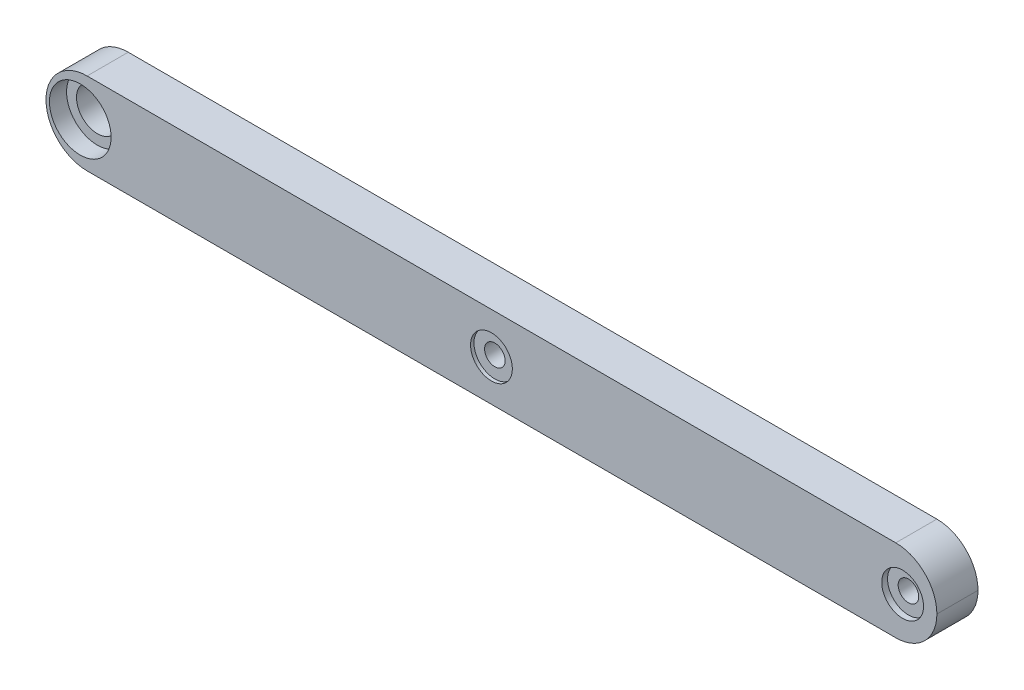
ISO-10303-21;
HEADER;
FILE_DESCRIPTION(('STEP AP214'),'2;1');
FILE_NAME('part.step','',(''),(''),'','','');
FILE_SCHEMA(('AUTOMOTIVE_DESIGN { 1 0 10303 214 1 1 1 1 }'));
ENDSEC;
DATA;
#1=APPLICATION_CONTEXT('core data for automotive mechanical design processes');
#2=APPLICATION_PROTOCOL_DEFINITION('international standard','automotive_design',2000,#1);
#3=PRODUCT_CONTEXT('',#1,'mechanical');
#4=PRODUCT('Part','Part','',(#3));
#5=PRODUCT_RELATED_PRODUCT_CATEGORY('part','',(#4));
#6=PRODUCT_DEFINITION_FORMATION('','',#4);
#7=PRODUCT_DEFINITION_CONTEXT('part definition',#1,'design');
#8=PRODUCT_DEFINITION('design','',#6,#7);
#9=PRODUCT_DEFINITION_SHAPE('','',#8);
#10=(LENGTH_UNIT() NAMED_UNIT(*) SI_UNIT(.MILLI.,.METRE.));
#11=(NAMED_UNIT(*) PLANE_ANGLE_UNIT() SI_UNIT($,.RADIAN.));
#12=(NAMED_UNIT(*) SI_UNIT($,.STERADIAN.) SOLID_ANGLE_UNIT());
#13=UNCERTAINTY_MEASURE_WITH_UNIT(LENGTH_MEASURE(1.E-05),#10,'distance_accuracy_value','');
#14=(GEOMETRIC_REPRESENTATION_CONTEXT(3) GLOBAL_UNCERTAINTY_ASSIGNED_CONTEXT((#13)) GLOBAL_UNIT_ASSIGNED_CONTEXT((#10,
#11,#12)) REPRESENTATION_CONTEXT('',''));
#15=CARTESIAN_POINT('',(0.,0.,0.));
#16=DIRECTION('',(0.,0.,1.));
#17=DIRECTION('',(1.,0.,0.));
#18=AXIS2_PLACEMENT_3D('',#15,#16,#17);
#19=CARTESIAN_POINT('',(55.3610271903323,6.23957703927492,0.));
#20=DIRECTION('',(0.,0.,1.));
#21=DIRECTION('',(1.,0.,0.));
#22=AXIS2_PLACEMENT_3D('',#19,#20,#21);
#23=CYLINDRICAL_SURFACE('',#22,1.5);
#24=CARTESIAN_POINT('',(55.3610271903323,6.23957703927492,0.));
#25=DIRECTION('',(0.,0.,1.));
#26=DIRECTION('',(1.,0.,0.));
#27=AXIS2_PLACEMENT_3D('',#24,#25,#26);
#28=CIRCLE('',#27,1.5);
#29=CARTESIAN_POINT('',(56.8610271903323,6.23957703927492,0.));
#30=VERTEX_POINT('',#29);
#31=EDGE_CURVE('E112',#30,#30,#28,.T.);
#32=ORIENTED_EDGE('',*,*,#31,.F.);
#33=EDGE_LOOP('',(#32));
#34=FACE_BOUND('',#33,.T.);
#35=CARTESIAN_POINT('',(55.3610271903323,6.23957703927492,5.15));
#36=DIRECTION('',(0.,0.,1.));
#37=DIRECTION('',(1.,0.,0.));
#38=AXIS2_PLACEMENT_3D('',#35,#36,#37);
#39=CIRCLE('',#38,1.5);
#40=CARTESIAN_POINT('',(56.8610271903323,6.23957703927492,5.15));
#41=VERTEX_POINT('',#40);
#42=EDGE_CURVE('E36',#41,#41,#39,.F.);
#43=ORIENTED_EDGE('',*,*,#42,.F.);
#44=EDGE_LOOP('',(#43));
#45=FACE_BOUND('',#44,.T.);
#46=ADVANCED_FACE('F32',(#34,#45),#23,.F.);
#47=CARTESIAN_POINT('',(-64.6389728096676,6.23957703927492,0.));
#48=DIRECTION('',(0.,0.,1.));
#49=DIRECTION('',(1.,0.,0.));
#50=AXIS2_PLACEMENT_3D('',#47,#48,#49);
#51=CYLINDRICAL_SURFACE('',#50,3.05);
#52=CARTESIAN_POINT('',(-64.6389728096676,6.23957703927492,0.));
#53=DIRECTION('',(0.,0.,1.));
#54=DIRECTION('',(1.,0.,0.));
#55=AXIS2_PLACEMENT_3D('',#52,#53,#54);
#56=CIRCLE('',#55,3.05);
#57=CARTESIAN_POINT('',(-61.5889728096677,6.23957703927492,0.));
#58=VERTEX_POINT('',#57);
#59=EDGE_CURVE('E116',#58,#58,#56,.T.);
#60=ORIENTED_EDGE('',*,*,#59,.F.);
#61=EDGE_LOOP('',(#60));
#62=FACE_BOUND('',#61,.T.);
#63=CARTESIAN_POINT('',(-64.6389728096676,6.23957703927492,3.5));
#64=DIRECTION('',(0.,0.,1.));
#65=DIRECTION('',(1.,0.,0.));
#66=AXIS2_PLACEMENT_3D('',#63,#64,#65);
#67=CIRCLE('',#66,3.05);
#68=CARTESIAN_POINT('',(-61.5889728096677,6.23957703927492,3.5));
#69=VERTEX_POINT('',#68);
#70=EDGE_CURVE('E140',#69,#69,#67,.F.);
#71=ORIENTED_EDGE('',*,*,#70,.F.);
#72=EDGE_LOOP('',(#71));
#73=FACE_BOUND('',#72,.T.);
#74=ADVANCED_FACE('F169',(#62,#73),#51,.F.);
#75=CARTESIAN_POINT('',(-4.63897280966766,6.23957703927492,0.));
#76=DIRECTION('',(0.,0.,1.));
#77=DIRECTION('',(1.,0.,0.));
#78=AXIS2_PLACEMENT_3D('',#75,#76,#77);
#79=CYLINDRICAL_SURFACE('',#78,1.5);
#80=CARTESIAN_POINT('',(-4.63897280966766,6.23957703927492,0.));
#81=DIRECTION('',(0.,0.,1.));
#82=DIRECTION('',(1.,0.,0.));
#83=AXIS2_PLACEMENT_3D('',#80,#81,#82);
#84=CIRCLE('',#83,1.5);
#85=CARTESIAN_POINT('',(-3.13897280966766,6.23957703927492,0.));
#86=VERTEX_POINT('',#85);
#87=EDGE_CURVE('E162',#86,#86,#84,.T.);
#88=ORIENTED_EDGE('',*,*,#87,.F.);
#89=EDGE_LOOP('',(#88));
#90=FACE_BOUND('',#89,.T.);
#91=CARTESIAN_POINT('',(-4.63897280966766,6.23957703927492,5.5));
#92=DIRECTION('',(0.,0.,1.));
#93=DIRECTION('',(1.,0.,0.));
#94=AXIS2_PLACEMENT_3D('',#91,#92,#93);
#95=CIRCLE('',#94,1.5);
#96=CARTESIAN_POINT('',(-3.13897280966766,6.23957703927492,5.5));
#97=VERTEX_POINT('',#96);
#98=EDGE_CURVE('E136',#97,#97,#95,.F.);
#99=ORIENTED_EDGE('',*,*,#98,.F.);
#100=EDGE_LOOP('',(#99));
#101=FACE_BOUND('',#100,.T.);
#102=ADVANCED_FACE('F172',(#90,#101),#79,.F.);
#103=CARTESIAN_POINT('',(-69.6389728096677,0.239577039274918,6.));
#104=DIRECTION('',(0.,1.,0.));
#105=DIRECTION('',(0.,0.,1.));
#106=AXIS2_PLACEMENT_3D('',#103,#104,#105);
#107=PLANE('',#106);
#108=DIRECTION('',(1.,0.,0.));
#109=VECTOR('',#108,1.);
#110=CARTESIAN_POINT('',(-69.6389728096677,0.239577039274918,6.));
#111=LINE('',#110,#109);
#112=CARTESIAN_POINT('',(-63.6389728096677,0.239577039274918,6.));
#113=VERTEX_POINT('',#112);
#114=CARTESIAN_POINT('',(54.3610271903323,0.239577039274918,6.));
#115=VERTEX_POINT('',#114);
#116=EDGE_CURVE('E105',#113,#115,#111,.T.);
#117=ORIENTED_EDGE('',*,*,#116,.F.);
#118=DIRECTION('',(0.,0.,-1.));
#119=VECTOR('',#118,1.);
#120=CARTESIAN_POINT('',(-63.6389728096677,0.239577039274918,6.));
#121=LINE('',#120,#119);
#122=CARTESIAN_POINT('',(-63.6389728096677,0.239577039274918,0.));
#123=VERTEX_POINT('',#122);
#124=EDGE_CURVE('E90',#113,#123,#121,.T.);
#125=ORIENTED_EDGE('',*,*,#124,.T.);
#126=DIRECTION('',(1.,0.,0.));
#127=VECTOR('',#126,1.);
#128=CARTESIAN_POINT('',(-69.6389728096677,0.239577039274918,0.));
#129=LINE('',#128,#127);
#130=CARTESIAN_POINT('',(54.3610271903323,0.239577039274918,0.));
#131=VERTEX_POINT('',#130);
#132=EDGE_CURVE('E102',#123,#131,#129,.T.);
#133=ORIENTED_EDGE('',*,*,#132,.T.);
#134=DIRECTION('',(0.,0.,-1.));
#135=VECTOR('',#134,1.);
#136=CARTESIAN_POINT('',(54.3610271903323,0.239577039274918,6.));
#137=LINE('',#136,#135);
#138=EDGE_CURVE('E107',#131,#115,#137,.F.);
#139=ORIENTED_EDGE('',*,*,#138,.T.);
#140=EDGE_LOOP('',(#117,#125,#133,#139));
#141=FACE_BOUND('',#140,.T.);
#142=ADVANCED_FACE('F34',(#141),#107,.F.);
#143=CARTESIAN_POINT('',(-69.6389728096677,12.2395770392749,6.));
#144=DIRECTION('',(0.,-1.,0.));
#145=DIRECTION('',(0.,0.,-1.));
#146=AXIS2_PLACEMENT_3D('',#143,#144,#145);
#147=PLANE('',#146);
#148=DIRECTION('',(-1.,0.,0.));
#149=VECTOR('',#148,1.);
#150=CARTESIAN_POINT('',(-69.6389728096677,12.2395770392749,0.));
#151=LINE('',#150,#149);
#152=CARTESIAN_POINT('',(54.3610271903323,12.2395770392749,0.));
#153=VERTEX_POINT('',#152);
#154=CARTESIAN_POINT('',(-63.6389728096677,12.2395770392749,0.));
#155=VERTEX_POINT('',#154);
#156=EDGE_CURVE('E111',#153,#155,#151,.T.);
#157=ORIENTED_EDGE('',*,*,#156,.T.);
#158=DIRECTION('',(0.,0.,-1.));
#159=VECTOR('',#158,1.);
#160=CARTESIAN_POINT('',(-63.6389728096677,12.2395770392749,6.));
#161=LINE('',#160,#159);
#162=CARTESIAN_POINT('',(-63.6389728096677,12.2395770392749,6.));
#163=VERTEX_POINT('',#162);
#164=EDGE_CURVE('E11',#155,#163,#161,.F.);
#165=ORIENTED_EDGE('',*,*,#164,.T.);
#166=DIRECTION('',(-1.,0.,0.));
#167=VECTOR('',#166,1.);
#168=CARTESIAN_POINT('',(-69.6389728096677,12.2395770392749,6.));
#169=LINE('',#168,#167);
#170=CARTESIAN_POINT('',(54.3610271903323,12.2395770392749,6.));
#171=VERTEX_POINT('',#170);
#172=EDGE_CURVE('E121',#171,#163,#169,.T.);
#173=ORIENTED_EDGE('',*,*,#172,.F.);
#174=DIRECTION('',(0.,0.,-1.));
#175=VECTOR('',#174,1.);
#176=CARTESIAN_POINT('',(54.3610271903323,12.2395770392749,6.));
#177=LINE('',#176,#175);
#178=EDGE_CURVE('E41',#171,#153,#177,.T.);
#179=ORIENTED_EDGE('',*,*,#178,.T.);
#180=EDGE_LOOP('',(#157,#165,#173,#179));
#181=FACE_BOUND('',#180,.T.);
#182=ADVANCED_FACE('F190',(#181),#147,.F.);
#183=CARTESIAN_POINT('',(-69.6389728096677,0.239577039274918,6.));
#184=DIRECTION('',(0.,0.,1.));
#185=DIRECTION('',(1.,0.,0.));
#186=AXIS2_PLACEMENT_3D('',#183,#184,#185);
#187=PLANE('',#186);
#188=CARTESIAN_POINT('',(55.3610271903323,6.23957703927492,6.));
#189=DIRECTION('',(0.,0.,1.));
#190=DIRECTION('',(1.,0.,0.));
#191=AXIS2_PLACEMENT_3D('',#188,#189,#190);
#192=CIRCLE('',#191,3.05);
#193=CARTESIAN_POINT('',(58.4110271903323,6.23957703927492,6.));
#194=VERTEX_POINT('',#193);
#195=EDGE_CURVE('E366',#194,#194,#192,.T.);
#196=ORIENTED_EDGE('',*,*,#195,.F.);
#197=EDGE_LOOP('',(#196));
#198=FACE_BOUND('',#197,.T.);
#199=CARTESIAN_POINT('',(-64.6389728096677,6.23957703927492,6.));
#200=DIRECTION('',(0.,0.,1.));
#201=DIRECTION('',(1.,0.,0.));
#202=AXIS2_PLACEMENT_3D('',#199,#200,#201);
#203=CIRCLE('',#202,4.5);
#204=CARTESIAN_POINT('',(-60.1389728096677,6.23957703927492,6.));
#205=VERTEX_POINT('',#204);
#206=EDGE_CURVE('E149',#205,#205,#203,.T.);
#207=ORIENTED_EDGE('',*,*,#206,.F.);
#208=EDGE_LOOP('',(#207));
#209=FACE_BOUND('',#208,.T.);
#210=CARTESIAN_POINT('',(-4.63897280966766,6.23957703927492,6.));
#211=DIRECTION('',(0.,0.,1.));
#212=DIRECTION('',(1.,0.,0.));
#213=AXIS2_PLACEMENT_3D('',#210,#211,#212);
#214=CIRCLE('',#213,3.05);
#215=CARTESIAN_POINT('',(-1.58897280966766,6.23957703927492,6.));
#216=VERTEX_POINT('',#215);
#217=EDGE_CURVE('E142',#216,#216,#214,.T.);
#218=ORIENTED_EDGE('',*,*,#217,.F.);
#219=EDGE_LOOP('',(#218));
#220=FACE_BOUND('',#219,.T.);
#221=CARTESIAN_POINT('',(-63.6389728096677,6.23957703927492,6.));
#222=DIRECTION('',(0.,0.,1.));
#223=DIRECTION('',(1.,0.,0.));
#224=AXIS2_PLACEMENT_3D('',#221,#222,#223);
#225=CIRCLE('',#224,6.);
#226=CARTESIAN_POINT('',(-69.6389728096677,6.23957703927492,6.));
#227=VERTEX_POINT('',#226);
#228=EDGE_CURVE('E130',#163,#227,#225,.T.);
#229=ORIENTED_EDGE('',*,*,#228,.T.);
#230=CARTESIAN_POINT('',(-63.6389728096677,6.23957703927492,6.));
#231=DIRECTION('',(0.,0.,1.));
#232=DIRECTION('',(1.,0.,0.));
#233=AXIS2_PLACEMENT_3D('',#230,#231,#232);
#234=CIRCLE('',#233,6.);
#235=EDGE_CURVE('E132',#227,#113,#234,.T.);
#236=ORIENTED_EDGE('',*,*,#235,.T.);
#237=ORIENTED_EDGE('',*,*,#116,.T.);
#238=CARTESIAN_POINT('',(54.3610271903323,6.23957703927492,6.));
#239=DIRECTION('',(0.,0.,1.));
#240=DIRECTION('',(1.,0.,0.));
#241=AXIS2_PLACEMENT_3D('',#238,#239,#240);
#242=CIRCLE('',#241,6.);
#243=CARTESIAN_POINT('',(60.3610271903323,6.23957703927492,6.));
#244=VERTEX_POINT('',#243);
#245=EDGE_CURVE('E96',#115,#244,#242,.T.);
#246=ORIENTED_EDGE('',*,*,#245,.T.);
#247=CARTESIAN_POINT('',(54.3610271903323,6.23957703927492,6.));
#248=DIRECTION('',(0.,0.,1.));
#249=DIRECTION('',(1.,0.,0.));
#250=AXIS2_PLACEMENT_3D('',#247,#248,#249);
#251=CIRCLE('',#250,6.);
#252=EDGE_CURVE('E54',#244,#171,#251,.T.);
#253=ORIENTED_EDGE('',*,*,#252,.T.);
#254=ORIENTED_EDGE('',*,*,#172,.T.);
#255=EDGE_LOOP('',(#229,#236,#237,#246,#253,#254));
#256=FACE_BOUND('',#255,.T.);
#257=ADVANCED_FACE('F187',(#198,#209,#220,#256),#187,.T.);
#258=CARTESIAN_POINT('',(-69.6389728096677,0.239577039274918,0.));
#259=DIRECTION('',(0.,0.,1.));
#260=DIRECTION('',(1.,0.,0.));
#261=AXIS2_PLACEMENT_3D('',#258,#259,#260);
#262=PLANE('',#261);
#263=ORIENTED_EDGE('',*,*,#87,.T.);
#264=EDGE_LOOP('',(#263));
#265=FACE_BOUND('',#264,.T.);
#266=ORIENTED_EDGE('',*,*,#59,.T.);
#267=EDGE_LOOP('',(#266));
#268=FACE_BOUND('',#267,.T.);
#269=ORIENTED_EDGE('',*,*,#31,.T.);
#270=EDGE_LOOP('',(#269));
#271=FACE_BOUND('',#270,.T.);
#272=ORIENTED_EDGE('',*,*,#132,.F.);
#273=CARTESIAN_POINT('',(-63.6389728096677,6.23957703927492,0.));
#274=DIRECTION('',(0.,0.,1.));
#275=DIRECTION('',(1.,0.,0.));
#276=AXIS2_PLACEMENT_3D('',#273,#274,#275);
#277=CIRCLE('',#276,6.);
#278=CARTESIAN_POINT('',(-69.6389728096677,6.23957703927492,0.));
#279=VERTEX_POINT('',#278);
#280=EDGE_CURVE('E86',#123,#279,#277,.F.);
#281=ORIENTED_EDGE('',*,*,#280,.T.);
#282=CARTESIAN_POINT('',(-63.6389728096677,6.23957703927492,0.));
#283=DIRECTION('',(0.,0.,1.));
#284=DIRECTION('',(1.,0.,0.));
#285=AXIS2_PLACEMENT_3D('',#282,#283,#284);
#286=CIRCLE('',#285,6.);
#287=EDGE_CURVE('E97',#279,#155,#286,.F.);
#288=ORIENTED_EDGE('',*,*,#287,.T.);
#289=ORIENTED_EDGE('',*,*,#156,.F.);
#290=CARTESIAN_POINT('',(54.3610271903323,6.23957703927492,0.));
#291=DIRECTION('',(0.,0.,1.));
#292=DIRECTION('',(1.,0.,0.));
#293=AXIS2_PLACEMENT_3D('',#290,#291,#292);
#294=CIRCLE('',#293,6.);
#295=CARTESIAN_POINT('',(60.3610271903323,6.23957703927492,0.));
#296=VERTEX_POINT('',#295);
#297=EDGE_CURVE('E125',#153,#296,#294,.F.);
#298=ORIENTED_EDGE('',*,*,#297,.T.);
#299=CARTESIAN_POINT('',(54.3610271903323,6.23957703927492,0.));
#300=DIRECTION('',(0.,0.,1.));
#301=DIRECTION('',(1.,0.,0.));
#302=AXIS2_PLACEMENT_3D('',#299,#300,#301);
#303=CIRCLE('',#302,6.);
#304=EDGE_CURVE('E106',#296,#131,#303,.F.);
#305=ORIENTED_EDGE('',*,*,#304,.T.);
#306=EDGE_LOOP('',(#272,#281,#288,#289,#298,#305));
#307=FACE_BOUND('',#306,.T.);
#308=ADVANCED_FACE('F109',(#265,#268,#271,#307),#262,.F.);
#309=CARTESIAN_POINT('',(-63.6389728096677,6.23957703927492,6.));
#310=DIRECTION('',(0.,0.,-1.));
#311=DIRECTION('',(-1.,0.,0.));
#312=AXIS2_PLACEMENT_3D('',#309,#310,#311);
#313=CYLINDRICAL_SURFACE('',#312,6.);
#314=DIRECTION('',(0.,0.,-1.));
#315=VECTOR('',#314,1.);
#316=CARTESIAN_POINT('',(-69.6389728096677,6.23957703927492,6.));
#317=LINE('',#316,#315);
#318=EDGE_CURVE('E92',#227,#279,#317,.T.);
#319=ORIENTED_EDGE('',*,*,#318,.F.);
#320=ORIENTED_EDGE('',*,*,#228,.F.);
#321=ORIENTED_EDGE('',*,*,#164,.F.);
#322=ORIENTED_EDGE('',*,*,#287,.F.);
#323=EDGE_LOOP('',(#319,#320,#321,#322));
#324=FACE_BOUND('',#323,.T.);
#325=ADVANCED_FACE('F186',(#324),#313,.T.);
#326=CARTESIAN_POINT('',(-63.6389728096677,6.23957703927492,6.));
#327=DIRECTION('',(0.,0.,-1.));
#328=DIRECTION('',(-1.,0.,0.));
#329=AXIS2_PLACEMENT_3D('',#326,#327,#328);
#330=CYLINDRICAL_SURFACE('',#329,6.);
#331=ORIENTED_EDGE('',*,*,#235,.F.);
#332=ORIENTED_EDGE('',*,*,#318,.T.);
#333=ORIENTED_EDGE('',*,*,#280,.F.);
#334=ORIENTED_EDGE('',*,*,#124,.F.);
#335=EDGE_LOOP('',(#331,#332,#333,#334));
#336=FACE_BOUND('',#335,.T.);
#337=ADVANCED_FACE('F89',(#336),#330,.T.);
#338=CARTESIAN_POINT('',(54.3610271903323,6.23957703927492,6.));
#339=DIRECTION('',(0.,0.,-1.));
#340=DIRECTION('',(-1.,0.,0.));
#341=AXIS2_PLACEMENT_3D('',#338,#339,#340);
#342=CYLINDRICAL_SURFACE('',#341,6.);
#343=DIRECTION('',(0.,0.,-1.));
#344=VECTOR('',#343,1.);
#345=CARTESIAN_POINT('',(60.3610271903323,6.23957703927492,6.));
#346=LINE('',#345,#344);
#347=EDGE_CURVE('E138',#244,#296,#346,.T.);
#348=ORIENTED_EDGE('',*,*,#347,.F.);
#349=ORIENTED_EDGE('',*,*,#245,.F.);
#350=ORIENTED_EDGE('',*,*,#138,.F.);
#351=ORIENTED_EDGE('',*,*,#304,.F.);
#352=EDGE_LOOP('',(#348,#349,#350,#351));
#353=FACE_BOUND('',#352,.T.);
#354=ADVANCED_FACE('F204',(#353),#342,.T.);
#355=CARTESIAN_POINT('',(54.3610271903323,6.23957703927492,6.));
#356=DIRECTION('',(0.,0.,-1.));
#357=DIRECTION('',(-1.,0.,0.));
#358=AXIS2_PLACEMENT_3D('',#355,#356,#357);
#359=CYLINDRICAL_SURFACE('',#358,6.);
#360=ORIENTED_EDGE('',*,*,#252,.F.);
#361=ORIENTED_EDGE('',*,*,#347,.T.);
#362=ORIENTED_EDGE('',*,*,#297,.F.);
#363=ORIENTED_EDGE('',*,*,#178,.F.);
#364=EDGE_LOOP('',(#360,#361,#362,#363));
#365=FACE_BOUND('',#364,.T.);
#366=ADVANCED_FACE('F201',(#365),#359,.T.);
#367=CARTESIAN_POINT('',(-4.63897280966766,6.23957703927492,5.5));
#368=DIRECTION('',(0.,0.,1.));
#369=DIRECTION('',(1.,0.,0.));
#370=AXIS2_PLACEMENT_3D('',#367,#368,#369);
#371=PLANE('',#370);
#372=CARTESIAN_POINT('',(-4.63897280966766,6.23957703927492,5.5));
#373=DIRECTION('',(0.,0.,1.));
#374=DIRECTION('',(1.,0.,0.));
#375=AXIS2_PLACEMENT_3D('',#372,#373,#374);
#376=CIRCLE('',#375,3.05);
#377=CARTESIAN_POINT('',(-1.58897280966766,6.23957703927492,5.5));
#378=VERTEX_POINT('',#377);
#379=EDGE_CURVE('E139',#378,#378,#376,.T.);
#380=ORIENTED_EDGE('',*,*,#379,.T.);
#381=EDGE_LOOP('',(#380));
#382=FACE_BOUND('',#381,.T.);
#383=ORIENTED_EDGE('',*,*,#98,.T.);
#384=EDGE_LOOP('',(#383));
#385=FACE_BOUND('',#384,.T.);
#386=ADVANCED_FACE('F212',(#382,#385),#371,.T.);
#387=CARTESIAN_POINT('',(-4.63897280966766,6.23957703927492,5.5));
#388=DIRECTION('',(0.,0.,1.));
#389=DIRECTION('',(1.,0.,0.));
#390=AXIS2_PLACEMENT_3D('',#387,#388,#389);
#391=CYLINDRICAL_SURFACE('',#390,3.05);
#392=ORIENTED_EDGE('',*,*,#379,.F.);
#393=EDGE_LOOP('',(#392));
#394=FACE_BOUND('',#393,.T.);
#395=ORIENTED_EDGE('',*,*,#217,.T.);
#396=EDGE_LOOP('',(#395));
#397=FACE_BOUND('',#396,.T.);
#398=ADVANCED_FACE('F245',(#394,#397),#391,.F.);
#399=CARTESIAN_POINT('',(-64.6389728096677,6.23957703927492,3.5));
#400=DIRECTION('',(0.,0.,1.));
#401=DIRECTION('',(1.,0.,0.));
#402=AXIS2_PLACEMENT_3D('',#399,#400,#401);
#403=PLANE('',#402);
#404=CARTESIAN_POINT('',(-64.6389728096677,6.23957703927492,3.5));
#405=DIRECTION('',(0.,0.,1.));
#406=DIRECTION('',(1.,0.,0.));
#407=AXIS2_PLACEMENT_3D('',#404,#405,#406);
#408=CIRCLE('',#407,4.5);
#409=CARTESIAN_POINT('',(-60.1389728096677,6.23957703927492,3.5));
#410=VERTEX_POINT('',#409);
#411=EDGE_CURVE('E143',#410,#410,#408,.T.);
#412=ORIENTED_EDGE('',*,*,#411,.T.);
#413=EDGE_LOOP('',(#412));
#414=FACE_BOUND('',#413,.T.);
#415=ORIENTED_EDGE('',*,*,#70,.T.);
#416=EDGE_LOOP('',(#415));
#417=FACE_BOUND('',#416,.T.);
#418=ADVANCED_FACE('F254',(#414,#417),#403,.T.);
#419=CARTESIAN_POINT('',(-64.6389728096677,6.23957703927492,3.5));
#420=DIRECTION('',(0.,0.,1.));
#421=DIRECTION('',(1.,0.,0.));
#422=AXIS2_PLACEMENT_3D('',#419,#420,#421);
#423=CYLINDRICAL_SURFACE('',#422,4.5);
#424=ORIENTED_EDGE('',*,*,#411,.F.);
#425=EDGE_LOOP('',(#424));
#426=FACE_BOUND('',#425,.T.);
#427=ORIENTED_EDGE('',*,*,#206,.T.);
#428=EDGE_LOOP('',(#427));
#429=FACE_BOUND('',#428,.T.);
#430=ADVANCED_FACE('F264',(#426,#429),#423,.F.);
#431=CARTESIAN_POINT('',(55.3610271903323,6.23957703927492,5.15));
#432=DIRECTION('',(0.,0.,1.));
#433=DIRECTION('',(1.,0.,0.));
#434=AXIS2_PLACEMENT_3D('',#431,#432,#433);
#435=PLANE('',#434);
#436=CARTESIAN_POINT('',(55.3610271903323,6.23957703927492,5.15));
#437=DIRECTION('',(0.,0.,1.));
#438=DIRECTION('',(1.,0.,0.));
#439=AXIS2_PLACEMENT_3D('',#436,#437,#438);
#440=CIRCLE('',#439,3.05);
#441=CARTESIAN_POINT('',(58.4110271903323,6.23957703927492,5.15));
#442=VERTEX_POINT('',#441);
#443=EDGE_CURVE('E363',#442,#442,#440,.T.);
#444=ORIENTED_EDGE('',*,*,#443,.T.);
#445=EDGE_LOOP('',(#444));
#446=FACE_BOUND('',#445,.T.);
#447=ORIENTED_EDGE('',*,*,#42,.T.);
#448=EDGE_LOOP('',(#447));
#449=FACE_BOUND('',#448,.T.);
#450=ADVANCED_FACE('F271',(#446,#449),#435,.T.);
#451=CARTESIAN_POINT('',(55.3610271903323,6.23957703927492,5.15));
#452=DIRECTION('',(0.,0.,1.));
#453=DIRECTION('',(1.,0.,0.));
#454=AXIS2_PLACEMENT_3D('',#451,#452,#453);
#455=CYLINDRICAL_SURFACE('',#454,3.05);
#456=ORIENTED_EDGE('',*,*,#443,.F.);
#457=EDGE_LOOP('',(#456));
#458=FACE_BOUND('',#457,.T.);
#459=ORIENTED_EDGE('',*,*,#195,.T.);
#460=EDGE_LOOP('',(#459));
#461=FACE_BOUND('',#460,.T.);
#462=ADVANCED_FACE('F280',(#458,#461),#455,.F.);
#463=CLOSED_SHELL('',(#46,#74,#102,#142,#182,#257,#308,#325,#337,#354,#366,#386,#398,#418,#430,
#450,#462));
#464=MANIFOLD_SOLID_BREP('B2',#463);
#465=ADVANCED_BREP_SHAPE_REPRESENTATION('',(#18,#464),#14);
#466=SHAPE_DEFINITION_REPRESENTATION(#9,#465);
ENDSEC;
END-ISO-10303-21;
